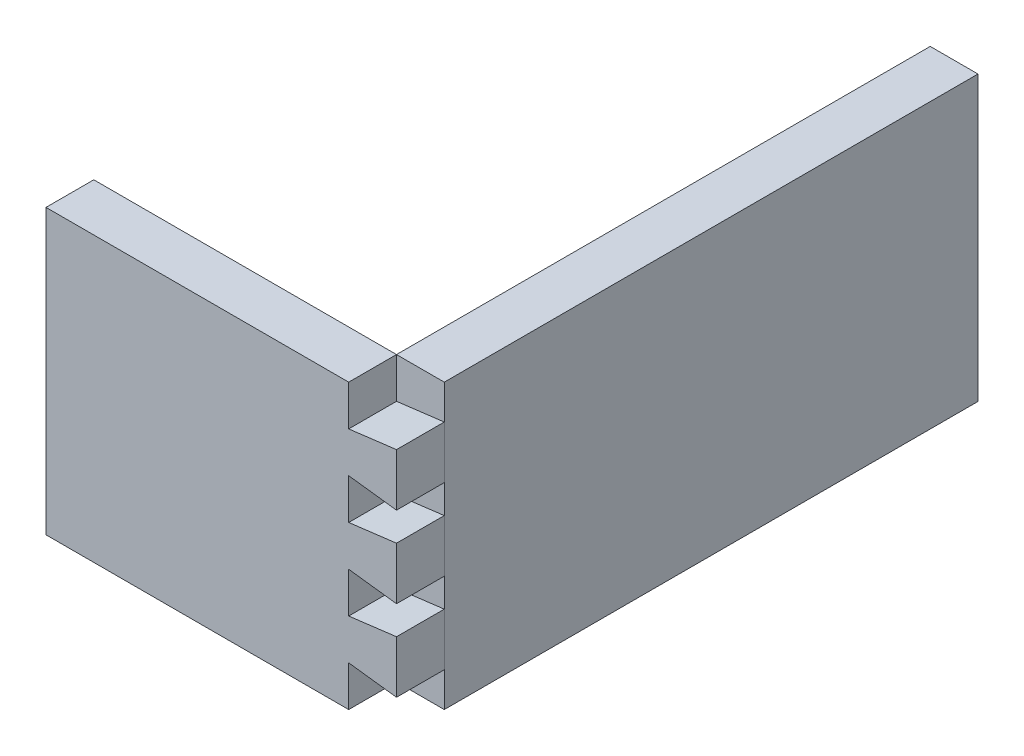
from build123d import *

# Parameters (mm, degrees)
SCHIZZO1_W                   = 110
SCHIZZO1_H                   = 89
ESTRUSIONE_ESTRUSIONE1_DEPTH = 15
TAGLIO_ESTRUSIONE1_DEPTH     = 15
SCHIZZO3_W                   = 15
SCHIZZO3_H                   = 89
ESTRUSIONE_ESTRUSIONE4_DEPTH = 167.5


with BuildPart() as part:
    # Schizzo1 → Estrusione-Estrusione1 (new body)
    with BuildSketch(Plane.XY):
        with Locations((-55, 44.5)):
            Rectangle(SCHIZZO1_W, SCHIZZO1_H)
    extrude(amount=ESTRUSIONE_ESTRUSIONE1_DEPTH)

    # Schizzo2 → Taglio-Estrusione1 (cut)
    with BuildSketch(Plane(origin=(0, 0, 0), x_dir=(-1, 0, 0), z_dir=(0, 0, -1))):
        Polygon((0, 89), (15, 89), (15, 76.285714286), (0, 78.160714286), align=None)
        Polygon((15, 63.571428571), (0, 61.696428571), (0, 52.732142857), (15, 50.857142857), align=None)
        Polygon((0, 36.267857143), (15, 38.142857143), (15, 25.428571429), (0, 27.303571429), align=None)
        Polygon((0, 0), (0, 10.839285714), (15, 12.714285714), (15, 0), align=None)
    extrude(amount=-TAGLIO_ESTRUSIONE1_DEPTH, mode=Mode.SUBTRACT)


with BuildPart() as body_2:
    # Schizzo3 → Estrusione-Estrusione4 (new body)
    with BuildSketch(Plane(origin=(0, 0, 0), x_dir=(-1, 0, 0), z_dir=(0, 0, -1))):
        with Locations((7.5, 44.5)):
            Rectangle(SCHIZZO3_W, SCHIZZO3_H)
    extrude(amount=ESTRUSIONE_ESTRUSIONE4_DEPTH)


solid = Compound([part.part, body_2.part])
